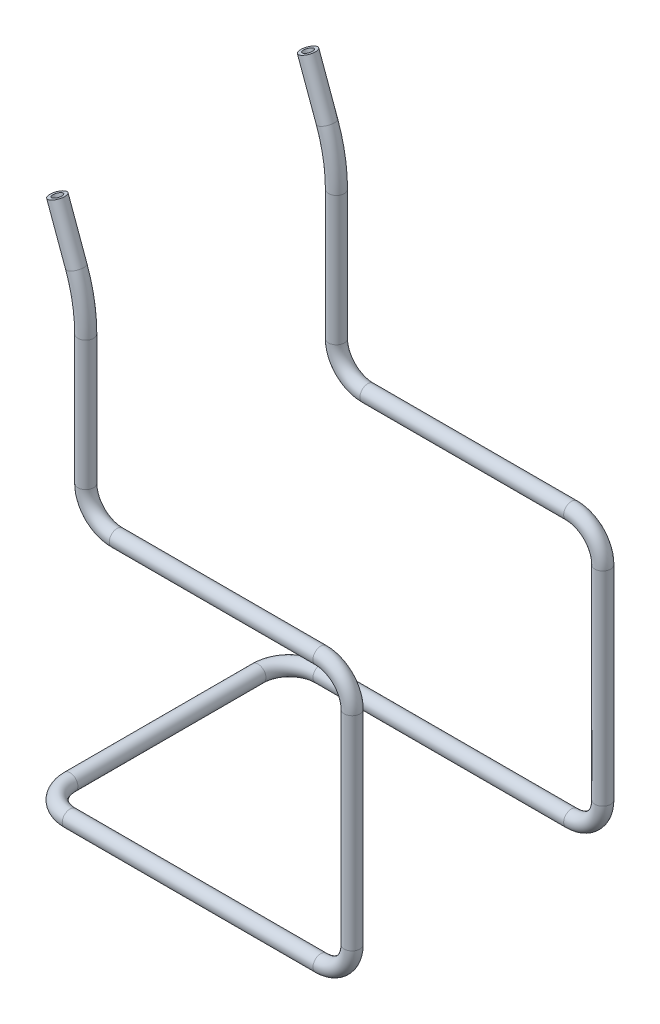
from build123d import *

# Parameters (mm, degrees)
SWEEP_THIN1_PROFILE_R   = 2.5
SWEEP_THIN1_PROFILE_R_2 = 1.5


with BuildPart() as part:
    # Sweep-Thin1: sweep along a curve in space
    with BuildLine() as sweep_thin1_path:
        Line((0, 0, 0), (0, 0, 30))
        ThreePointArc((0, 0, 30), (2.928932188, 0, 37.071067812), (10, 0, 40))
        Line((10, 0, 40), (90, 0, 40))
        ThreePointArc((90, 0, 40), (97.071067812, 2.928932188, 40), (100, 10, 40))
        Line((100, 10, 40), (100, 75, 40))
        ThreePointArc((100, 75, 40), (97.071067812, 82.071067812, 40), (90, 85, 40))
        Line((90, 85, 40), (25, 85, 40))
        ThreePointArc((25, 85, 40), (17.928932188, 87.928932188, 40), (15, 95, 40))
        Line((15, 95, 40), (15, 136.281796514, 40))
        ThreePointArc((15, 136.281796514, 40), (14.240387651, 144.964205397, 40), (11.984631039, 153.38280368, 40))
        Line((11.984631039, 153.38280368, 40), (5.936466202, 170, 40))
    # Sweep-Thin1 profile (on start of the path) → Sweep-Thin1 (sweep)
    with BuildSketch(Plane.XY):
        Circle(SWEEP_THIN1_PROFILE_R)
        Circle(SWEEP_THIN1_PROFILE_R_2, mode=Mode.SUBTRACT)
    sweep_thin1 = sweep(path=sweep_thin1_path.line)

    # Mirror1: Sweep-Thin1 across plane
    add(sweep_thin1.mirror(Plane.XY))


solid = part.part
